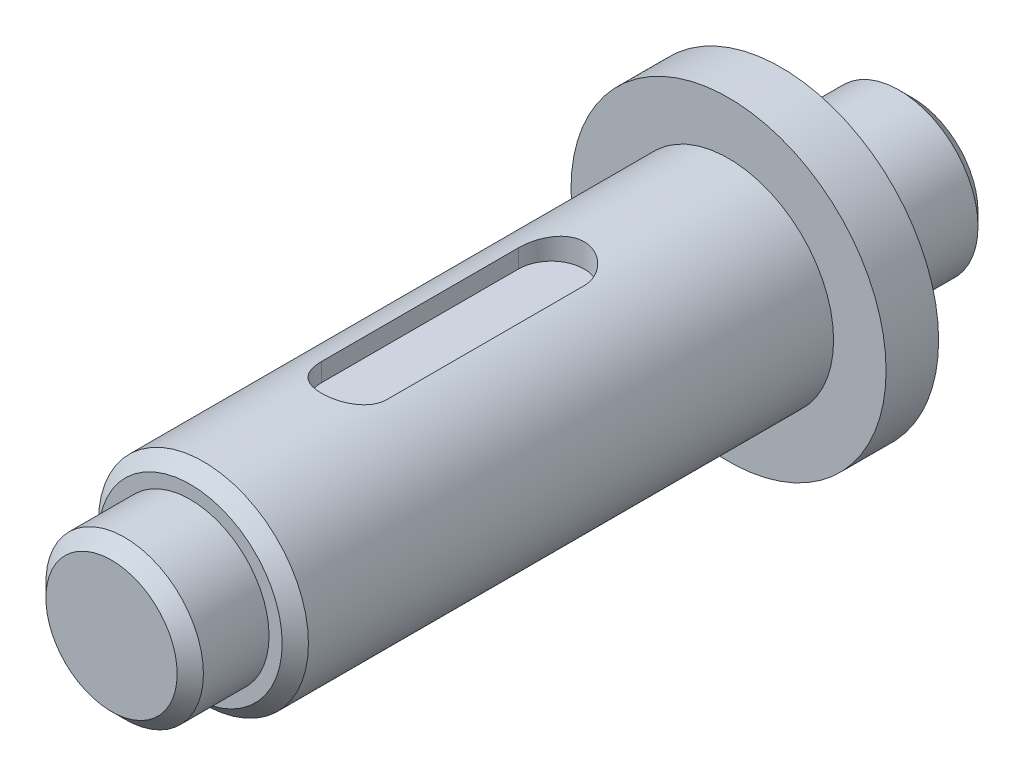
from build123d import *

# Parameters (mm, degrees)
SKETCH1_R           = 6
BOSS_EXTRUDE1_DEPTH = 10
SKETCH2_R           = 12
BOSS_EXTRUDE2_DEPTH = 4
SKETCH3_R           = 8
BOSS_EXTRUDE3_DEPTH = 41
SKETCH4_R           = 6
BOSS_EXTRUDE4_DEPTH = 6
CHAMFER2_SIZE       = 1
CUT_EXTRUDE1_DEPTH  = 1.8


with BuildPart() as part:
    # Sketch1 → Boss-Extrude1 (new body)
    with BuildSketch(Plane.XY):
        Circle(SKETCH1_R)
    extrude(amount=BOSS_EXTRUDE1_DEPTH)

    # Sketch2 → Boss-Extrude2 (add)
    with BuildSketch(Plane.XY.offset(10)):
        Circle(SKETCH2_R)
    extrude(amount=BOSS_EXTRUDE2_DEPTH)

    # Sketch3 → Boss-Extrude3 (add)
    with BuildSketch(Plane.XY.offset(14)):
        Circle(SKETCH3_R)
    extrude(amount=BOSS_EXTRUDE3_DEPTH)

    # Sketch4 → Boss-Extrude4 (add)
    with BuildSketch(Plane.XY.offset(55)):
        Circle(SKETCH4_R)
    extrude(amount=BOSS_EXTRUDE4_DEPTH)

    # Chamfer2
    chamfer2_edges = [part.edges().sort_by_distance(p)[0] for p in [
        (-8, 0, 55),
        (-6, 0, 61),
        (-6, 0, 0),
    ]]
    chamfer(chamfer2_edges, length=CHAMFER2_SIZE)

    # Sketch321 → Cut-Extrude1 (cut)
    with BuildSketch(Plane(origin=(-1.029580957, 8, 61), x_dir=(0, 0, 1), z_dir=(0, -1, 0))):
        with BuildLine():
            Line((-18.5, 1.470419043), (-33.5, 1.470419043))
            ThreePointArc((-33.5, 1.470419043), (-36, -1.029580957), (-33.5, -3.529580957))
            Line((-33.5, -3.529580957), (-18.5, -3.529580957))
            ThreePointArc((-18.5, -3.529580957), (-16, -1.029580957), (-18.5, 1.470419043))
        make_face()
    extrude(amount=CUT_EXTRUDE1_DEPTH, mode=Mode.SUBTRACT)


solid = part.part
